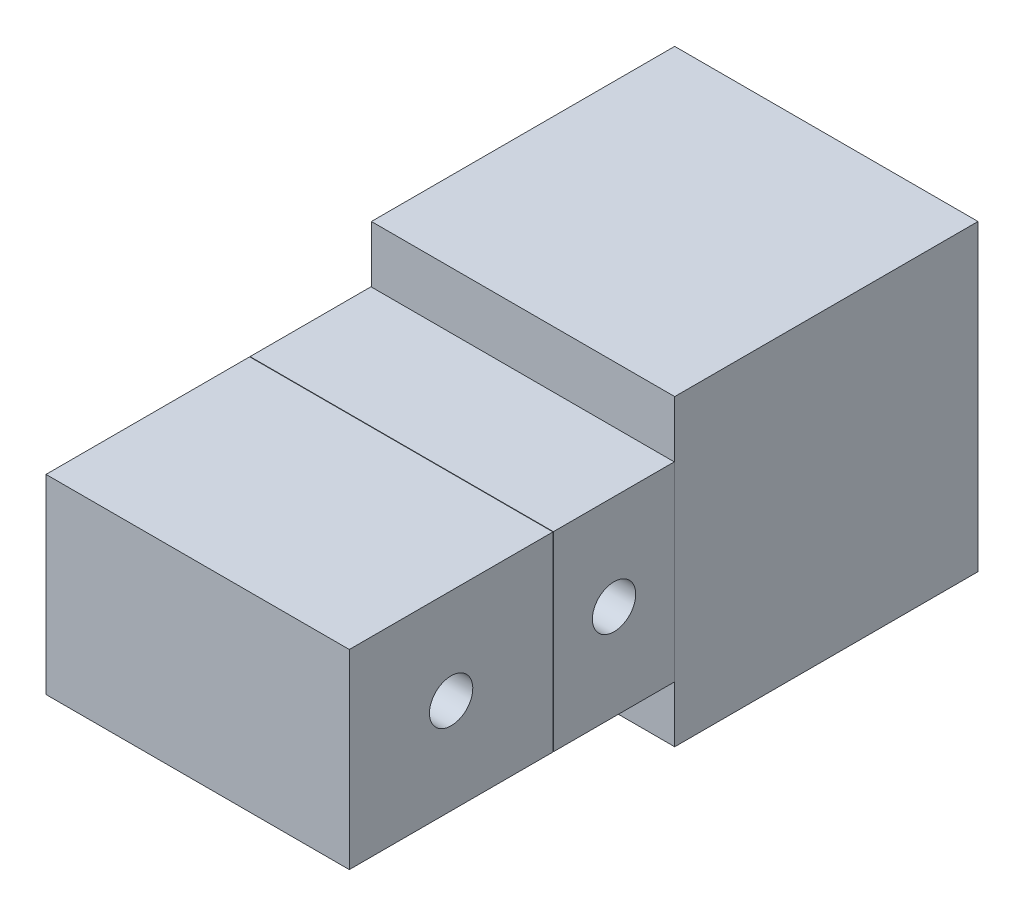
ISO-10303-21;
HEADER;
FILE_DESCRIPTION(('STEP AP214'),'2;1');
FILE_NAME('part.step','',(''),(''),'','','');
FILE_SCHEMA(('AUTOMOTIVE_DESIGN { 1 0 10303 214 1 1 1 1 }'));
ENDSEC;
DATA;
#1=APPLICATION_CONTEXT('core data for automotive mechanical design processes');
#2=APPLICATION_PROTOCOL_DEFINITION('international standard','automotive_design',2000,#1);
#3=PRODUCT_CONTEXT('',#1,'mechanical');
#4=PRODUCT('Part','Part','',(#3));
#5=PRODUCT_RELATED_PRODUCT_CATEGORY('part','',(#4));
#6=PRODUCT_DEFINITION_FORMATION('','',#4);
#7=PRODUCT_DEFINITION_CONTEXT('part definition',#1,'design');
#8=PRODUCT_DEFINITION('design','',#6,#7);
#9=PRODUCT_DEFINITION_SHAPE('','',#8);
#10=(LENGTH_UNIT() NAMED_UNIT(*) SI_UNIT(.MILLI.,.METRE.));
#11=(NAMED_UNIT(*) PLANE_ANGLE_UNIT() SI_UNIT($,.RADIAN.));
#12=(NAMED_UNIT(*) SI_UNIT($,.STERADIAN.) SOLID_ANGLE_UNIT());
#13=UNCERTAINTY_MEASURE_WITH_UNIT(LENGTH_MEASURE(1.E-05),#10,'distance_accuracy_value','');
#14=(GEOMETRIC_REPRESENTATION_CONTEXT(3) GLOBAL_UNCERTAINTY_ASSIGNED_CONTEXT((#13)) GLOBAL_UNIT_ASSIGNED_CONTEXT((#10,
#11,#12)) REPRESENTATION_CONTEXT('',''));
#15=CARTESIAN_POINT('',(0.,0.,0.));
#16=DIRECTION('',(0.,0.,1.));
#17=DIRECTION('',(1.,0.,0.));
#18=AXIS2_PLACEMENT_3D('',#15,#16,#17);
#19=CARTESIAN_POINT('',(-35.,-22.,145.1));
#20=DIRECTION('',(1.,0.,0.));
#21=DIRECTION('',(0.,1.,0.));
#22=AXIS2_PLACEMENT_3D('',#19,#20,#21);
#23=PLANE('',#22);
#24=CARTESIAN_POINT('',(-35.,0.,121.6));
#25=DIRECTION('',(-1.,0.,0.));
#26=DIRECTION('',(0.,-1.,0.));
#27=AXIS2_PLACEMENT_3D('',#24,#25,#26);
#28=CIRCLE('',#27,5.00000000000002);
#29=CARTESIAN_POINT('',(-35.,-5.00000000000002,121.6));
#30=VERTEX_POINT('',#29);
#31=EDGE_CURVE('E101',#30,#30,#28,.T.);
#32=ORIENTED_EDGE('',*,*,#31,.F.);
#33=EDGE_LOOP('',(#32));
#34=FACE_BOUND('',#33,.T.);
#35=DIRECTION('',(0.,-1.,0.));
#36=VECTOR('',#35,1.);
#37=CARTESIAN_POINT('',(-35.,-22.,98.1));
#38=LINE('',#37,#36);
#39=CARTESIAN_POINT('',(-35.,22.,98.1));
#40=VERTEX_POINT('',#39);
#41=CARTESIAN_POINT('',(-35.,-22.,98.1));
#42=VERTEX_POINT('',#41);
#43=EDGE_CURVE('E85',#40,#42,#38,.T.);
#44=ORIENTED_EDGE('',*,*,#43,.T.);
#45=DIRECTION('',(0.,0.,-1.));
#46=VECTOR('',#45,1.);
#47=CARTESIAN_POINT('',(-35.,-22.,145.1));
#48=LINE('',#47,#46);
#49=CARTESIAN_POINT('',(-35.,-22.,145.1));
#50=VERTEX_POINT('',#49);
#51=EDGE_CURVE('E12',#50,#42,#48,.T.);
#52=ORIENTED_EDGE('',*,*,#51,.F.);
#53=DIRECTION('',(0.,-1.,0.));
#54=VECTOR('',#53,1.);
#55=CARTESIAN_POINT('',(-35.,-22.,145.1));
#56=LINE('',#55,#54);
#57=CARTESIAN_POINT('',(-35.,22.,145.1));
#58=VERTEX_POINT('',#57);
#59=EDGE_CURVE('E108',#58,#50,#56,.T.);
#60=ORIENTED_EDGE('',*,*,#59,.F.);
#61=DIRECTION('',(0.,0.,-1.));
#62=VECTOR('',#61,1.);
#63=CARTESIAN_POINT('',(-35.,22.,145.1));
#64=LINE('',#63,#62);
#65=EDGE_CURVE('E97',#58,#40,#64,.T.);
#66=ORIENTED_EDGE('',*,*,#65,.T.);
#67=EDGE_LOOP('',(#44,#52,#60,#66));
#68=FACE_BOUND('',#67,.T.);
#69=ADVANCED_FACE('F41',(#34,#68),#23,.F.);
#70=CARTESIAN_POINT('',(35.,-22.,145.1));
#71=DIRECTION('',(0.,1.,0.));
#72=DIRECTION('',(0.,0.,1.));
#73=AXIS2_PLACEMENT_3D('',#70,#71,#72);
#74=PLANE('',#73);
#75=DIRECTION('',(1.,0.,0.));
#76=VECTOR('',#75,1.);
#77=CARTESIAN_POINT('',(35.,-22.,98.1));
#78=LINE('',#77,#76);
#79=CARTESIAN_POINT('',(35.,-22.,98.1));
#80=VERTEX_POINT('',#79);
#81=EDGE_CURVE('E81',#42,#80,#78,.T.);
#82=ORIENTED_EDGE('',*,*,#81,.T.);
#83=DIRECTION('',(0.,0.,-1.));
#84=VECTOR('',#83,1.);
#85=CARTESIAN_POINT('',(35.,-22.,145.1));
#86=LINE('',#85,#84);
#87=CARTESIAN_POINT('',(35.,-22.,145.1));
#88=VERTEX_POINT('',#87);
#89=EDGE_CURVE('E48',#88,#80,#86,.T.);
#90=ORIENTED_EDGE('',*,*,#89,.F.);
#91=DIRECTION('',(1.,0.,0.));
#92=VECTOR('',#91,1.);
#93=CARTESIAN_POINT('',(35.,-22.,145.1));
#94=LINE('',#93,#92);
#95=EDGE_CURVE('E93',#50,#88,#94,.T.);
#96=ORIENTED_EDGE('',*,*,#95,.F.);
#97=ORIENTED_EDGE('',*,*,#51,.T.);
#98=EDGE_LOOP('',(#82,#90,#96,#97));
#99=FACE_BOUND('',#98,.T.);
#100=ADVANCED_FACE('F92',(#99),#74,.F.);
#101=CARTESIAN_POINT('',(35.,22.,145.1));
#102=DIRECTION('',(-1.,0.,0.));
#103=DIRECTION('',(0.,-1.,0.));
#104=AXIS2_PLACEMENT_3D('',#101,#102,#103);
#105=PLANE('',#104);
#106=CARTESIAN_POINT('',(35.,0.,121.6));
#107=DIRECTION('',(-1.,0.,0.));
#108=DIRECTION('',(0.,-1.,0.));
#109=AXIS2_PLACEMENT_3D('',#106,#107,#108);
#110=CIRCLE('',#109,5.00000000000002);
#111=CARTESIAN_POINT('',(35.,-5.00000000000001,121.6));
#112=VERTEX_POINT('',#111);
#113=EDGE_CURVE('E98',#112,#112,#110,.T.);
#114=ORIENTED_EDGE('',*,*,#113,.T.);
#115=EDGE_LOOP('',(#114));
#116=FACE_BOUND('',#115,.T.);
#117=DIRECTION('',(0.,1.,0.));
#118=VECTOR('',#117,1.);
#119=CARTESIAN_POINT('',(35.,22.,98.1));
#120=LINE('',#119,#118);
#121=CARTESIAN_POINT('',(35.,22.,98.1));
#122=VERTEX_POINT('',#121);
#123=EDGE_CURVE('E86',#80,#122,#120,.T.);
#124=ORIENTED_EDGE('',*,*,#123,.T.);
#125=DIRECTION('',(0.,0.,-1.));
#126=VECTOR('',#125,1.);
#127=CARTESIAN_POINT('',(35.,22.,145.1));
#128=LINE('',#127,#126);
#129=CARTESIAN_POINT('',(35.,22.,145.1));
#130=VERTEX_POINT('',#129);
#131=EDGE_CURVE('E114',#130,#122,#128,.T.);
#132=ORIENTED_EDGE('',*,*,#131,.F.);
#133=DIRECTION('',(0.,1.,0.));
#134=VECTOR('',#133,1.);
#135=CARTESIAN_POINT('',(35.,22.,145.1));
#136=LINE('',#135,#134);
#137=EDGE_CURVE('E60',#88,#130,#136,.T.);
#138=ORIENTED_EDGE('',*,*,#137,.F.);
#139=ORIENTED_EDGE('',*,*,#89,.T.);
#140=EDGE_LOOP('',(#124,#132,#138,#139));
#141=FACE_BOUND('',#140,.T.);
#142=ADVANCED_FACE('F117',(#116,#141),#105,.F.);
#143=CARTESIAN_POINT('',(-35.,22.,145.1));
#144=DIRECTION('',(0.,-1.,0.));
#145=DIRECTION('',(0.,0.,-1.));
#146=AXIS2_PLACEMENT_3D('',#143,#144,#145);
#147=PLANE('',#146);
#148=DIRECTION('',(-1.,0.,0.));
#149=VECTOR('',#148,1.);
#150=CARTESIAN_POINT('',(-35.,22.,98.1));
#151=LINE('',#150,#149);
#152=EDGE_CURVE('E106',#122,#40,#151,.T.);
#153=ORIENTED_EDGE('',*,*,#152,.T.);
#154=ORIENTED_EDGE('',*,*,#65,.F.);
#155=DIRECTION('',(-1.,0.,0.));
#156=VECTOR('',#155,1.);
#157=CARTESIAN_POINT('',(-35.,22.,145.1));
#158=LINE('',#157,#156);
#159=EDGE_CURVE('E55',#130,#58,#158,.T.);
#160=ORIENTED_EDGE('',*,*,#159,.F.);
#161=ORIENTED_EDGE('',*,*,#131,.T.);
#162=EDGE_LOOP('',(#153,#154,#160,#161));
#163=FACE_BOUND('',#162,.T.);
#164=ADVANCED_FACE('F119',(#163),#147,.F.);
#165=CARTESIAN_POINT('',(-35.,22.,145.1));
#166=DIRECTION('',(0.,0.,-1.));
#167=DIRECTION('',(-1.,0.,0.));
#168=AXIS2_PLACEMENT_3D('',#165,#166,#167);
#169=PLANE('',#168);
#170=ORIENTED_EDGE('',*,*,#59,.T.);
#171=ORIENTED_EDGE('',*,*,#95,.T.);
#172=ORIENTED_EDGE('',*,*,#137,.T.);
#173=ORIENTED_EDGE('',*,*,#159,.T.);
#174=EDGE_LOOP('',(#170,#171,#172,#173));
#175=FACE_BOUND('',#174,.T.);
#176=ADVANCED_FACE('F120',(#175),#169,.F.);
#177=CARTESIAN_POINT('',(-35.,22.,98.1));
#178=DIRECTION('',(0.,0.,-1.));
#179=DIRECTION('',(-1.,0.,0.));
#180=AXIS2_PLACEMENT_3D('',#177,#178,#179);
#181=PLANE('',#180);
#182=ORIENTED_EDGE('',*,*,#43,.F.);
#183=ORIENTED_EDGE('',*,*,#152,.F.);
#184=ORIENTED_EDGE('',*,*,#123,.F.);
#185=ORIENTED_EDGE('',*,*,#81,.F.);
#186=EDGE_LOOP('',(#182,#183,#184,#185));
#187=FACE_BOUND('',#186,.T.);
#188=ADVANCED_FACE('F82',(#187),#181,.T.);
#189=CARTESIAN_POINT('',(35.,0.,121.6));
#190=DIRECTION('',(-1.,0.,0.));
#191=DIRECTION('',(0.,-1.,0.));
#192=AXIS2_PLACEMENT_3D('',#189,#190,#191);
#193=CYLINDRICAL_SURFACE('',#192,5.00000000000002);
#194=ORIENTED_EDGE('',*,*,#113,.F.);
#195=EDGE_LOOP('',(#194));
#196=FACE_BOUND('',#195,.T.);
#197=ORIENTED_EDGE('',*,*,#31,.T.);
#198=EDGE_LOOP('',(#197));
#199=FACE_BOUND('',#198,.T.);
#200=ADVANCED_FACE('F127',(#196,#199),#193,.F.);
#201=CLOSED_SHELL('',(#69,#100,#142,#164,#176,#188,#200));
#202=MANIFOLD_SOLID_BREP('B2',#201);
#203=CARTESIAN_POINT('',(35.,22.,98.));
#204=DIRECTION('',(0.,-1.,0.));
#205=DIRECTION('',(0.,0.,-1.));
#206=AXIS2_PLACEMENT_3D('',#203,#204,#205);
#207=PLANE('',#206);
#208=DIRECTION('',(-1.,0.,0.));
#209=VECTOR('',#208,1.);
#210=CARTESIAN_POINT('',(35.,22.,70.1));
#211=LINE('',#210,#209);
#212=CARTESIAN_POINT('',(35.,22.,70.1));
#213=VERTEX_POINT('',#212);
#214=CARTESIAN_POINT('',(-35.,22.,70.1));
#215=VERTEX_POINT('',#214);
#216=EDGE_CURVE('E238',#213,#215,#211,.T.);
#217=ORIENTED_EDGE('',*,*,#216,.T.);
#218=DIRECTION('',(0.,0.,-1.));
#219=VECTOR('',#218,1.);
#220=CARTESIAN_POINT('',(-35.,22.,98.));
#221=LINE('',#220,#219);
#222=CARTESIAN_POINT('',(-35.,22.,98.));
#223=VERTEX_POINT('',#222);
#224=EDGE_CURVE('E39',#223,#215,#221,.T.);
#225=ORIENTED_EDGE('',*,*,#224,.F.);
#226=DIRECTION('',(-1.,0.,0.));
#227=VECTOR('',#226,1.);
#228=CARTESIAN_POINT('',(35.,22.,98.));
#229=LINE('',#228,#227);
#230=CARTESIAN_POINT('',(35.,22.,98.));
#231=VERTEX_POINT('',#230);
#232=EDGE_CURVE('E261',#231,#223,#229,.T.);
#233=ORIENTED_EDGE('',*,*,#232,.F.);
#234=DIRECTION('',(0.,0.,-1.));
#235=VECTOR('',#234,1.);
#236=CARTESIAN_POINT('',(35.,22.,98.));
#237=LINE('',#236,#235);
#238=EDGE_CURVE('E250',#231,#213,#237,.T.);
#239=ORIENTED_EDGE('',*,*,#238,.T.);
#240=EDGE_LOOP('',(#217,#225,#233,#239));
#241=FACE_BOUND('',#240,.T.);
#242=ADVANCED_FACE('F194',(#241),#207,.F.);
#243=CARTESIAN_POINT('',(-35.,22.,98.));
#244=DIRECTION('',(1.,0.,0.));
#245=DIRECTION('',(0.,1.,0.));
#246=AXIS2_PLACEMENT_3D('',#243,#244,#245);
#247=PLANE('',#246);
#248=CARTESIAN_POINT('',(-35.,0.,84.));
#249=DIRECTION('',(-1.,0.,0.));
#250=DIRECTION('',(0.,-1.,0.));
#251=AXIS2_PLACEMENT_3D('',#248,#249,#250);
#252=CIRCLE('',#251,5.);
#253=CARTESIAN_POINT('',(-35.,-5.00000000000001,84.));
#254=VERTEX_POINT('',#253);
#255=EDGE_CURVE('E254',#254,#254,#252,.T.);
#256=ORIENTED_EDGE('',*,*,#255,.F.);
#257=EDGE_LOOP('',(#256));
#258=FACE_BOUND('',#257,.T.);
#259=DIRECTION('',(0.,-1.,0.));
#260=VECTOR('',#259,1.);
#261=CARTESIAN_POINT('',(-35.,22.,70.1));
#262=LINE('',#261,#260);
#263=CARTESIAN_POINT('',(-35.,-22.,70.1));
#264=VERTEX_POINT('',#263);
#265=EDGE_CURVE('E234',#215,#264,#262,.T.);
#266=ORIENTED_EDGE('',*,*,#265,.T.);
#267=DIRECTION('',(0.,0.,-1.));
#268=VECTOR('',#267,1.);
#269=CARTESIAN_POINT('',(-35.,-22.,98.));
#270=LINE('',#269,#268);
#271=CARTESIAN_POINT('',(-35.,-22.,98.));
#272=VERTEX_POINT('',#271);
#273=EDGE_CURVE('E201',#272,#264,#270,.T.);
#274=ORIENTED_EDGE('',*,*,#273,.F.);
#275=DIRECTION('',(0.,-1.,0.));
#276=VECTOR('',#275,1.);
#277=CARTESIAN_POINT('',(-35.,22.,98.));
#278=LINE('',#277,#276);
#279=EDGE_CURVE('E246',#223,#272,#278,.T.);
#280=ORIENTED_EDGE('',*,*,#279,.F.);
#281=ORIENTED_EDGE('',*,*,#224,.T.);
#282=EDGE_LOOP('',(#266,#274,#280,#281));
#283=FACE_BOUND('',#282,.T.);
#284=ADVANCED_FACE('F245',(#258,#283),#247,.F.);
#285=CARTESIAN_POINT('',(-35.,-22.,98.));
#286=DIRECTION('',(0.,1.,0.));
#287=DIRECTION('',(0.,0.,1.));
#288=AXIS2_PLACEMENT_3D('',#285,#286,#287);
#289=PLANE('',#288);
#290=DIRECTION('',(1.,0.,0.));
#291=VECTOR('',#290,1.);
#292=CARTESIAN_POINT('',(-35.,-22.,70.1));
#293=LINE('',#292,#291);
#294=CARTESIAN_POINT('',(35.,-22.,70.1));
#295=VERTEX_POINT('',#294);
#296=EDGE_CURVE('E239',#264,#295,#293,.T.);
#297=ORIENTED_EDGE('',*,*,#296,.T.);
#298=DIRECTION('',(0.,0.,-1.));
#299=VECTOR('',#298,1.);
#300=CARTESIAN_POINT('',(35.,-22.,98.));
#301=LINE('',#300,#299);
#302=CARTESIAN_POINT('',(35.,-22.,98.));
#303=VERTEX_POINT('',#302);
#304=EDGE_CURVE('E267',#303,#295,#301,.T.);
#305=ORIENTED_EDGE('',*,*,#304,.F.);
#306=DIRECTION('',(1.,0.,0.));
#307=VECTOR('',#306,1.);
#308=CARTESIAN_POINT('',(-35.,-22.,98.));
#309=LINE('',#308,#307);
#310=EDGE_CURVE('E213',#272,#303,#309,.T.);
#311=ORIENTED_EDGE('',*,*,#310,.F.);
#312=ORIENTED_EDGE('',*,*,#273,.T.);
#313=EDGE_LOOP('',(#297,#305,#311,#312));
#314=FACE_BOUND('',#313,.T.);
#315=ADVANCED_FACE('F270',(#314),#289,.F.);
#316=CARTESIAN_POINT('',(35.,-22.,98.));
#317=DIRECTION('',(-1.,0.,0.));
#318=DIRECTION('',(0.,-1.,0.));
#319=AXIS2_PLACEMENT_3D('',#316,#317,#318);
#320=PLANE('',#319);
#321=CARTESIAN_POINT('',(35.,0.,84.));
#322=DIRECTION('',(-1.,0.,0.));
#323=DIRECTION('',(0.,-1.,0.));
#324=AXIS2_PLACEMENT_3D('',#321,#322,#323);
#325=CIRCLE('',#324,5.);
#326=CARTESIAN_POINT('',(35.,-5.,84.));
#327=VERTEX_POINT('',#326);
#328=EDGE_CURVE('E251',#327,#327,#325,.T.);
#329=ORIENTED_EDGE('',*,*,#328,.T.);
#330=EDGE_LOOP('',(#329));
#331=FACE_BOUND('',#330,.T.);
#332=DIRECTION('',(0.,1.,0.));
#333=VECTOR('',#332,1.);
#334=CARTESIAN_POINT('',(35.,-22.,70.1));
#335=LINE('',#334,#333);
#336=EDGE_CURVE('E259',#295,#213,#335,.T.);
#337=ORIENTED_EDGE('',*,*,#336,.T.);
#338=ORIENTED_EDGE('',*,*,#238,.F.);
#339=DIRECTION('',(0.,1.,0.));
#340=VECTOR('',#339,1.);
#341=CARTESIAN_POINT('',(35.,-22.,98.));
#342=LINE('',#341,#340);
#343=EDGE_CURVE('E208',#303,#231,#342,.T.);
#344=ORIENTED_EDGE('',*,*,#343,.F.);
#345=ORIENTED_EDGE('',*,*,#304,.T.);
#346=EDGE_LOOP('',(#337,#338,#344,#345));
#347=FACE_BOUND('',#346,.T.);
#348=ADVANCED_FACE('F272',(#331,#347),#320,.F.);
#349=CARTESIAN_POINT('',(-35.,22.,98.));
#350=DIRECTION('',(0.,0.,1.));
#351=DIRECTION('',(1.,0.,0.));
#352=AXIS2_PLACEMENT_3D('',#349,#350,#351);
#353=PLANE('',#352);
#354=ORIENTED_EDGE('',*,*,#232,.T.);
#355=ORIENTED_EDGE('',*,*,#279,.T.);
#356=ORIENTED_EDGE('',*,*,#310,.T.);
#357=ORIENTED_EDGE('',*,*,#343,.T.);
#358=EDGE_LOOP('',(#354,#355,#356,#357));
#359=FACE_BOUND('',#358,.T.);
#360=ADVANCED_FACE('F273',(#359),#353,.T.);
#361=CARTESIAN_POINT('',(-35.,22.,70.1));
#362=DIRECTION('',(0.,0.,1.));
#363=DIRECTION('',(1.,0.,0.));
#364=AXIS2_PLACEMENT_3D('',#361,#362,#363);
#365=PLANE('',#364);
#366=ORIENTED_EDGE('',*,*,#216,.F.);
#367=ORIENTED_EDGE('',*,*,#336,.F.);
#368=ORIENTED_EDGE('',*,*,#296,.F.);
#369=ORIENTED_EDGE('',*,*,#265,.F.);
#370=EDGE_LOOP('',(#366,#367,#368,#369));
#371=FACE_BOUND('',#370,.T.);
#372=ADVANCED_FACE('F235',(#371),#365,.F.);
#373=CARTESIAN_POINT('',(35.,0.,84.));
#374=DIRECTION('',(-1.,0.,0.));
#375=DIRECTION('',(0.,-1.,0.));
#376=AXIS2_PLACEMENT_3D('',#373,#374,#375);
#377=CYLINDRICAL_SURFACE('',#376,5.);
#378=ORIENTED_EDGE('',*,*,#328,.F.);
#379=EDGE_LOOP('',(#378));
#380=FACE_BOUND('',#379,.T.);
#381=ORIENTED_EDGE('',*,*,#255,.T.);
#382=EDGE_LOOP('',(#381));
#383=FACE_BOUND('',#382,.T.);
#384=ADVANCED_FACE('F280',(#380,#383),#377,.F.);
#385=CLOSED_SHELL('',(#242,#284,#315,#348,#360,#372,#384));
#386=MANIFOLD_SOLID_BREP('B6',#385);
#387=CARTESIAN_POINT('',(-35.,35.,70.));
#388=DIRECTION('',(1.,0.,0.));
#389=DIRECTION('',(0.,1.,0.));
#390=AXIS2_PLACEMENT_3D('',#387,#388,#389);
#391=PLANE('',#390);
#392=CARTESIAN_POINT('',(-35.,0.,15.));
#393=DIRECTION('',(1.,0.,0.));
#394=DIRECTION('',(0.,1.,0.));
#395=AXIS2_PLACEMENT_3D('',#392,#393,#394);
#396=CIRCLE('',#395,5.);
#397=CARTESIAN_POINT('',(-35.,5.,15.));
#398=VERTEX_POINT('',#397);
#399=EDGE_CURVE('E450',#398,#398,#396,.T.);
#400=ORIENTED_EDGE('',*,*,#399,.T.);
#401=EDGE_LOOP('',(#400));
#402=FACE_BOUND('',#401,.T.);
#403=DIRECTION('',(0.,-1.,0.));
#404=VECTOR('',#403,1.);
#405=CARTESIAN_POINT('',(-35.,35.,0.));
#406=LINE('',#405,#404);
#407=CARTESIAN_POINT('',(-35.,35.,0.));
#408=VERTEX_POINT('',#407);
#409=CARTESIAN_POINT('',(-35.,-35.,0.));
#410=VERTEX_POINT('',#409);
#411=EDGE_CURVE('E492',#408,#410,#406,.T.);
#412=ORIENTED_EDGE('',*,*,#411,.T.);
#413=DIRECTION('',(0.,0.,-1.));
#414=VECTOR('',#413,1.);
#415=CARTESIAN_POINT('',(-35.,-35.,70.));
#416=LINE('',#415,#414);
#417=CARTESIAN_POINT('',(-35.,-35.,70.));
#418=VERTEX_POINT('',#417);
#419=EDGE_CURVE('E192',#418,#410,#416,.T.);
#420=ORIENTED_EDGE('',*,*,#419,.F.);
#421=DIRECTION('',(0.,-1.,0.));
#422=VECTOR('',#421,1.);
#423=CARTESIAN_POINT('',(-35.,35.,70.));
#424=LINE('',#423,#422);
#425=CARTESIAN_POINT('',(-35.,35.,70.));
#426=VERTEX_POINT('',#425);
#427=EDGE_CURVE('E501',#426,#418,#424,.T.);
#428=ORIENTED_EDGE('',*,*,#427,.F.);
#429=DIRECTION('',(0.,0.,-1.));
#430=VECTOR('',#429,1.);
#431=CARTESIAN_POINT('',(-35.,35.,70.));
#432=LINE('',#431,#430);
#433=EDGE_CURVE('E507',#426,#408,#432,.T.);
#434=ORIENTED_EDGE('',*,*,#433,.T.);
#435=EDGE_LOOP('',(#412,#420,#428,#434));
#436=FACE_BOUND('',#435,.T.);
#437=CARTESIAN_POINT('',(-35.,0.,55.));
#438=DIRECTION('',(1.,0.,0.));
#439=DIRECTION('',(0.,1.,0.));
#440=AXIS2_PLACEMENT_3D('',#437,#438,#439);
#441=CIRCLE('',#440,5.);
#442=CARTESIAN_POINT('',(-35.,4.99999999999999,55.));
#443=VERTEX_POINT('',#442);
#444=EDGE_CURVE('E444',#443,#443,#441,.T.);
#445=ORIENTED_EDGE('',*,*,#444,.T.);
#446=EDGE_LOOP('',(#445));
#447=FACE_BOUND('',#446,.T.);
#448=ADVANCED_FACE('F338',(#402,#436,#447),#391,.F.);
#449=CARTESIAN_POINT('',(-35.,-35.,70.));
#450=DIRECTION('',(0.,1.,0.));
#451=DIRECTION('',(0.,0.,1.));
#452=AXIS2_PLACEMENT_3D('',#449,#450,#451);
#453=PLANE('',#452);
#454=CARTESIAN_POINT('',(27.5,-35.,7.5));
#455=DIRECTION('',(0.,-1.,0.));
#456=DIRECTION('',(0.,0.,-1.));
#457=AXIS2_PLACEMENT_3D('',#454,#455,#456);
#458=CIRCLE('',#457,4.5);
#459=CARTESIAN_POINT('',(27.5,-35.,3.));
#460=VERTEX_POINT('',#459);
#461=EDGE_CURVE('E400',#460,#460,#458,.T.);
#462=ORIENTED_EDGE('',*,*,#461,.F.);
#463=EDGE_LOOP('',(#462));
#464=FACE_BOUND('',#463,.T.);
#465=CARTESIAN_POINT('',(-27.5,-35.,7.5));
#466=DIRECTION('',(0.,-1.,0.));
#467=DIRECTION('',(0.,0.,-1.));
#468=AXIS2_PLACEMENT_3D('',#465,#466,#467);
#469=CIRCLE('',#468,4.5);
#470=CARTESIAN_POINT('',(-27.5,-35.,3.));
#471=VERTEX_POINT('',#470);
#472=EDGE_CURVE('E411',#471,#471,#469,.T.);
#473=ORIENTED_EDGE('',*,*,#472,.F.);
#474=EDGE_LOOP('',(#473));
#475=FACE_BOUND('',#474,.T.);
#476=CARTESIAN_POINT('',(-27.5,-35.,62.5));
#477=DIRECTION('',(0.,-1.,0.));
#478=DIRECTION('',(0.,0.,-1.));
#479=AXIS2_PLACEMENT_3D('',#476,#477,#478);
#480=CIRCLE('',#479,4.5);
#481=CARTESIAN_POINT('',(-27.5,-35.,58.));
#482=VERTEX_POINT('',#481);
#483=EDGE_CURVE('E420',#482,#482,#480,.T.);
#484=ORIENTED_EDGE('',*,*,#483,.F.);
#485=EDGE_LOOP('',(#484));
#486=FACE_BOUND('',#485,.T.);
#487=CARTESIAN_POINT('',(27.5,-35.,62.5));
#488=DIRECTION('',(0.,-1.,0.));
#489=DIRECTION('',(0.,0.,-1.));
#490=AXIS2_PLACEMENT_3D('',#487,#488,#489);
#491=CIRCLE('',#490,4.5);
#492=CARTESIAN_POINT('',(27.5,-35.,58.));
#493=VERTEX_POINT('',#492);
#494=EDGE_CURVE('E429',#493,#493,#491,.T.);
#495=ORIENTED_EDGE('',*,*,#494,.F.);
#496=EDGE_LOOP('',(#495));
#497=FACE_BOUND('',#496,.T.);
#498=CARTESIAN_POINT('',(-20.,-35.,35.));
#499=DIRECTION('',(0.,1.,0.));
#500=DIRECTION('',(0.,0.,1.));
#501=AXIS2_PLACEMENT_3D('',#498,#499,#500);
#502=CIRCLE('',#501,5.);
#503=CARTESIAN_POINT('',(-20.,-35.,40.));
#504=VERTEX_POINT('',#503);
#505=EDGE_CURVE('E462',#504,#504,#502,.T.);
#506=ORIENTED_EDGE('',*,*,#505,.T.);
#507=EDGE_LOOP('',(#506));
#508=FACE_BOUND('',#507,.T.);
#509=DIRECTION('',(1.,0.,0.));
#510=VECTOR('',#509,1.);
#511=CARTESIAN_POINT('',(-35.,-35.,0.));
#512=LINE('',#511,#510);
#513=CARTESIAN_POINT('',(35.,-35.,0.));
#514=VERTEX_POINT('',#513);
#515=EDGE_CURVE('E495',#410,#514,#512,.T.);
#516=ORIENTED_EDGE('',*,*,#515,.T.);
#517=DIRECTION('',(0.,0.,-1.));
#518=VECTOR('',#517,1.);
#519=CARTESIAN_POINT('',(35.,-35.,70.));
#520=LINE('',#519,#518);
#521=CARTESIAN_POINT('',(35.,-35.,70.));
#522=VERTEX_POINT('',#521);
#523=EDGE_CURVE('E345',#522,#514,#520,.T.);
#524=ORIENTED_EDGE('',*,*,#523,.F.);
#525=DIRECTION('',(1.,0.,0.));
#526=VECTOR('',#525,1.);
#527=CARTESIAN_POINT('',(-35.,-35.,70.));
#528=LINE('',#527,#526);
#529=EDGE_CURVE('E503',#418,#522,#528,.T.);
#530=ORIENTED_EDGE('',*,*,#529,.F.);
#531=ORIENTED_EDGE('',*,*,#419,.T.);
#532=EDGE_LOOP('',(#516,#524,#530,#531));
#533=FACE_BOUND('',#532,.T.);
#534=CARTESIAN_POINT('',(20.,-35.,35.));
#535=DIRECTION('',(0.,1.,0.));
#536=DIRECTION('',(0.,0.,1.));
#537=AXIS2_PLACEMENT_3D('',#534,#535,#536);
#538=CIRCLE('',#537,5.);
#539=CARTESIAN_POINT('',(20.,-35.,40.));
#540=VERTEX_POINT('',#539);
#541=EDGE_CURVE('E456',#540,#540,#538,.T.);
#542=ORIENTED_EDGE('',*,*,#541,.T.);
#543=EDGE_LOOP('',(#542));
#544=FACE_BOUND('',#543,.T.);
#545=ADVANCED_FACE('F529',(#464,#475,#486,#497,#508,#533,#544),#453,.F.);
#546=CARTESIAN_POINT('',(35.,35.,70.));
#547=DIRECTION('',(-1.,0.,0.));
#548=DIRECTION('',(0.,-1.,0.));
#549=AXIS2_PLACEMENT_3D('',#546,#547,#548);
#550=PLANE('',#549);
#551=DIRECTION('',(0.,1.,0.));
#552=VECTOR('',#551,1.);
#553=CARTESIAN_POINT('',(35.,35.,0.));
#554=LINE('',#553,#552);
#555=CARTESIAN_POINT('',(35.,35.,0.));
#556=VERTEX_POINT('',#555);
#557=EDGE_CURVE('E497',#514,#556,#554,.T.);
#558=ORIENTED_EDGE('',*,*,#557,.T.);
#559=DIRECTION('',(0.,0.,-1.));
#560=VECTOR('',#559,1.);
#561=CARTESIAN_POINT('',(35.,35.,70.));
#562=LINE('',#561,#560);
#563=CARTESIAN_POINT('',(35.,35.,70.));
#564=VERTEX_POINT('',#563);
#565=EDGE_CURVE('E510',#564,#556,#562,.T.);
#566=ORIENTED_EDGE('',*,*,#565,.F.);
#567=DIRECTION('',(0.,1.,0.));
#568=VECTOR('',#567,1.);
#569=CARTESIAN_POINT('',(35.,35.,70.));
#570=LINE('',#569,#568);
#571=EDGE_CURVE('E357',#522,#564,#570,.T.);
#572=ORIENTED_EDGE('',*,*,#571,.F.);
#573=ORIENTED_EDGE('',*,*,#523,.T.);
#574=EDGE_LOOP('',(#558,#566,#572,#573));
#575=FACE_BOUND('',#574,.T.);
#576=ADVANCED_FACE('F516',(#575),#550,.F.);
#577=CARTESIAN_POINT('',(-35.,35.,70.));
#578=DIRECTION('',(0.,-1.,0.));
#579=DIRECTION('',(0.,0.,-1.));
#580=AXIS2_PLACEMENT_3D('',#577,#578,#579);
#581=PLANE('',#580);
#582=DIRECTION('',(-1.,0.,0.));
#583=VECTOR('',#582,1.);
#584=CARTESIAN_POINT('',(-35.,35.,0.));
#585=LINE('',#584,#583);
#586=EDGE_CURVE('E499',#556,#408,#585,.T.);
#587=ORIENTED_EDGE('',*,*,#586,.T.);
#588=ORIENTED_EDGE('',*,*,#433,.F.);
#589=DIRECTION('',(-1.,0.,0.));
#590=VECTOR('',#589,1.);
#591=CARTESIAN_POINT('',(-35.,35.,70.));
#592=LINE('',#591,#590);
#593=EDGE_CURVE('E352',#564,#426,#592,.T.);
#594=ORIENTED_EDGE('',*,*,#593,.F.);
#595=ORIENTED_EDGE('',*,*,#565,.T.);
#596=EDGE_LOOP('',(#587,#588,#594,#595));
#597=FACE_BOUND('',#596,.T.);
#598=ADVANCED_FACE('F523',(#597),#581,.F.);
#599=CARTESIAN_POINT('',(-35.,-35.,70.));
#600=DIRECTION('',(0.,0.,1.));
#601=DIRECTION('',(1.,0.,0.));
#602=AXIS2_PLACEMENT_3D('',#599,#600,#601);
#603=PLANE('',#602);
#604=ORIENTED_EDGE('',*,*,#427,.T.);
#605=ORIENTED_EDGE('',*,*,#529,.T.);
#606=ORIENTED_EDGE('',*,*,#571,.T.);
#607=ORIENTED_EDGE('',*,*,#593,.T.);
#608=EDGE_LOOP('',(#604,#605,#606,#607));
#609=FACE_BOUND('',#608,.T.);
#610=ADVANCED_FACE('F528',(#609),#603,.T.);
#611=CARTESIAN_POINT('',(-35.,-35.,0.));
#612=DIRECTION('',(0.,0.,1.));
#613=DIRECTION('',(1.,0.,0.));
#614=AXIS2_PLACEMENT_3D('',#611,#612,#613);
#615=PLANE('',#614);
#616=CARTESIAN_POINT('',(0.,-29.,0.));
#617=DIRECTION('',(0.,0.,-1.));
#618=DIRECTION('',(-1.,0.,0.));
#619=AXIS2_PLACEMENT_3D('',#616,#617,#618);
#620=CIRCLE('',#619,2.5);
#621=CARTESIAN_POINT('',(-2.5,-29.,0.));
#622=VERTEX_POINT('',#621);
#623=EDGE_CURVE('E432',#622,#622,#620,.T.);
#624=ORIENTED_EDGE('',*,*,#623,.F.);
#625=EDGE_LOOP('',(#624));
#626=FACE_BOUND('',#625,.T.);
#627=CARTESIAN_POINT('',(0.,29.,0.));
#628=DIRECTION('',(0.,0.,-1.));
#629=DIRECTION('',(-1.,0.,0.));
#630=AXIS2_PLACEMENT_3D('',#627,#628,#629);
#631=CIRCLE('',#630,2.5);
#632=CARTESIAN_POINT('',(-2.5,29.,0.));
#633=VERTEX_POINT('',#632);
#634=EDGE_CURVE('E438',#633,#633,#631,.T.);
#635=ORIENTED_EDGE('',*,*,#634,.F.);
#636=EDGE_LOOP('',(#635));
#637=FACE_BOUND('',#636,.T.);
#638=CARTESIAN_POINT('',(19.,-17.,0.));
#639=DIRECTION('',(0.,0.,-1.));
#640=DIRECTION('',(-1.,0.,0.));
#641=AXIS2_PLACEMENT_3D('',#638,#639,#640);
#642=CIRCLE('',#641,4.);
#643=CARTESIAN_POINT('',(15.,-17.,0.));
#644=VERTEX_POINT('',#643);
#645=EDGE_CURVE('E468',#644,#644,#642,.T.);
#646=ORIENTED_EDGE('',*,*,#645,.F.);
#647=EDGE_LOOP('',(#646));
#648=FACE_BOUND('',#647,.T.);
#649=CARTESIAN_POINT('',(-19.,-17.,0.));
#650=DIRECTION('',(0.,0.,-1.));
#651=DIRECTION('',(-1.,0.,0.));
#652=AXIS2_PLACEMENT_3D('',#649,#650,#651);
#653=CIRCLE('',#652,4.);
#654=CARTESIAN_POINT('',(-23.,-17.,0.));
#655=VERTEX_POINT('',#654);
#656=EDGE_CURVE('E474',#655,#655,#653,.T.);
#657=ORIENTED_EDGE('',*,*,#656,.F.);
#658=EDGE_LOOP('',(#657));
#659=FACE_BOUND('',#658,.T.);
#660=CARTESIAN_POINT('',(-19.,17.,0.));
#661=DIRECTION('',(0.,0.,-1.));
#662=DIRECTION('',(-1.,0.,0.));
#663=AXIS2_PLACEMENT_3D('',#660,#661,#662);
#664=CIRCLE('',#663,4.);
#665=CARTESIAN_POINT('',(-23.,17.,0.));
#666=VERTEX_POINT('',#665);
#667=EDGE_CURVE('E480',#666,#666,#664,.T.);
#668=ORIENTED_EDGE('',*,*,#667,.F.);
#669=EDGE_LOOP('',(#668));
#670=FACE_BOUND('',#669,.T.);
#671=CARTESIAN_POINT('',(19.,17.,0.));
#672=DIRECTION('',(0.,0.,-1.));
#673=DIRECTION('',(-1.,0.,0.));
#674=AXIS2_PLACEMENT_3D('',#671,#672,#673);
#675=CIRCLE('',#674,4.);
#676=CARTESIAN_POINT('',(15.,17.,0.));
#677=VERTEX_POINT('',#676);
#678=EDGE_CURVE('E486',#677,#677,#675,.T.);
#679=ORIENTED_EDGE('',*,*,#678,.F.);
#680=EDGE_LOOP('',(#679));
#681=FACE_BOUND('',#680,.T.);
#682=ORIENTED_EDGE('',*,*,#411,.F.);
#683=ORIENTED_EDGE('',*,*,#586,.F.);
#684=ORIENTED_EDGE('',*,*,#557,.F.);
#685=ORIENTED_EDGE('',*,*,#515,.F.);
#686=EDGE_LOOP('',(#682,#683,#684,#685));
#687=FACE_BOUND('',#686,.T.);
#688=ADVANCED_FACE('F521',(#626,#637,#648,#659,#670,#681,#687),#615,.F.);
#689=CARTESIAN_POINT('',(19.,17.,30.));
#690=DIRECTION('',(0.,0.,-1.));
#691=DIRECTION('',(-1.,0.,0.));
#692=AXIS2_PLACEMENT_3D('',#689,#690,#691);
#693=CYLINDRICAL_SURFACE('',#692,4.);
#694=CARTESIAN_POINT('',(19.,17.,30.));
#695=DIRECTION('',(0.,0.,-1.));
#696=DIRECTION('',(-1.,0.,0.));
#697=AXIS2_PLACEMENT_3D('',#694,#695,#696);
#698=CIRCLE('',#697,4.);
#699=CARTESIAN_POINT('',(15.,17.,30.));
#700=VERTEX_POINT('',#699);
#701=EDGE_CURVE('E489',#700,#700,#698,.T.);
#702=ORIENTED_EDGE('',*,*,#701,.F.);
#703=EDGE_LOOP('',(#702));
#704=FACE_BOUND('',#703,.T.);
#705=ORIENTED_EDGE('',*,*,#678,.T.);
#706=EDGE_LOOP('',(#705));
#707=FACE_BOUND('',#706,.T.);
#708=ADVANCED_FACE('F680',(#704,#707),#693,.F.);
#709=CARTESIAN_POINT('',(19.,17.,30.));
#710=DIRECTION('',(0.,0.,-1.));
#711=DIRECTION('',(-1.,0.,0.));
#712=AXIS2_PLACEMENT_3D('',#709,#710,#711);
#713=PLANE('',#712);
#714=ORIENTED_EDGE('',*,*,#701,.T.);
#715=EDGE_LOOP('',(#714));
#716=FACE_BOUND('',#715,.T.);
#717=ADVANCED_FACE('F676',(#716),#713,.T.);
#718=CARTESIAN_POINT('',(-19.,17.,30.));
#719=DIRECTION('',(0.,0.,-1.));
#720=DIRECTION('',(-1.,0.,0.));
#721=AXIS2_PLACEMENT_3D('',#718,#719,#720);
#722=CYLINDRICAL_SURFACE('',#721,4.);
#723=CARTESIAN_POINT('',(-19.,17.,30.));
#724=DIRECTION('',(0.,0.,-1.));
#725=DIRECTION('',(-1.,0.,0.));
#726=AXIS2_PLACEMENT_3D('',#723,#724,#725);
#727=CIRCLE('',#726,4.);
#728=CARTESIAN_POINT('',(-23.,17.,30.));
#729=VERTEX_POINT('',#728);
#730=EDGE_CURVE('E483',#729,#729,#727,.T.);
#731=ORIENTED_EDGE('',*,*,#730,.F.);
#732=EDGE_LOOP('',(#731));
#733=FACE_BOUND('',#732,.T.);
#734=ORIENTED_EDGE('',*,*,#667,.T.);
#735=EDGE_LOOP('',(#734));
#736=FACE_BOUND('',#735,.T.);
#737=ADVANCED_FACE('F672',(#733,#736),#722,.F.);
#738=CARTESIAN_POINT('',(-19.,17.,30.));
#739=DIRECTION('',(0.,0.,-1.));
#740=DIRECTION('',(-1.,0.,0.));
#741=AXIS2_PLACEMENT_3D('',#738,#739,#740);
#742=PLANE('',#741);
#743=ORIENTED_EDGE('',*,*,#730,.T.);
#744=EDGE_LOOP('',(#743));
#745=FACE_BOUND('',#744,.T.);
#746=ADVANCED_FACE('F668',(#745),#742,.T.);
#747=CARTESIAN_POINT('',(-19.,-17.,30.));
#748=DIRECTION('',(0.,0.,-1.));
#749=DIRECTION('',(-1.,0.,0.));
#750=AXIS2_PLACEMENT_3D('',#747,#748,#749);
#751=CYLINDRICAL_SURFACE('',#750,4.);
#752=CARTESIAN_POINT('',(-19.,-17.,30.));
#753=DIRECTION('',(0.,0.,-1.));
#754=DIRECTION('',(-1.,0.,0.));
#755=AXIS2_PLACEMENT_3D('',#752,#753,#754);
#756=CIRCLE('',#755,4.);
#757=CARTESIAN_POINT('',(-23.,-17.,30.));
#758=VERTEX_POINT('',#757);
#759=EDGE_CURVE('E477',#758,#758,#756,.T.);
#760=ORIENTED_EDGE('',*,*,#759,.F.);
#761=EDGE_LOOP('',(#760));
#762=FACE_BOUND('',#761,.T.);
#763=ORIENTED_EDGE('',*,*,#656,.T.);
#764=EDGE_LOOP('',(#763));
#765=FACE_BOUND('',#764,.T.);
#766=ADVANCED_FACE('F664',(#762,#765),#751,.F.);
#767=CARTESIAN_POINT('',(-19.,-17.,30.));
#768=DIRECTION('',(0.,0.,-1.));
#769=DIRECTION('',(-1.,0.,0.));
#770=AXIS2_PLACEMENT_3D('',#767,#768,#769);
#771=PLANE('',#770);
#772=ORIENTED_EDGE('',*,*,#759,.T.);
#773=EDGE_LOOP('',(#772));
#774=FACE_BOUND('',#773,.T.);
#775=ADVANCED_FACE('F660',(#774),#771,.T.);
#776=CARTESIAN_POINT('',(19.,-17.,30.));
#777=DIRECTION('',(0.,0.,-1.));
#778=DIRECTION('',(-1.,0.,0.));
#779=AXIS2_PLACEMENT_3D('',#776,#777,#778);
#780=CYLINDRICAL_SURFACE('',#779,4.);
#781=CARTESIAN_POINT('',(19.,-17.,30.));
#782=DIRECTION('',(0.,0.,-1.));
#783=DIRECTION('',(-1.,0.,0.));
#784=AXIS2_PLACEMENT_3D('',#781,#782,#783);
#785=CIRCLE('',#784,4.);
#786=CARTESIAN_POINT('',(15.,-17.,30.));
#787=VERTEX_POINT('',#786);
#788=EDGE_CURVE('E471',#787,#787,#785,.T.);
#789=ORIENTED_EDGE('',*,*,#788,.F.);
#790=EDGE_LOOP('',(#789));
#791=FACE_BOUND('',#790,.T.);
#792=ORIENTED_EDGE('',*,*,#645,.T.);
#793=EDGE_LOOP('',(#792));
#794=FACE_BOUND('',#793,.T.);
#795=ADVANCED_FACE('F654',(#791,#794),#780,.F.);
#796=CARTESIAN_POINT('',(19.,-17.,30.));
#797=DIRECTION('',(0.,0.,-1.));
#798=DIRECTION('',(-1.,0.,0.));
#799=AXIS2_PLACEMENT_3D('',#796,#797,#798);
#800=PLANE('',#799);
#801=ORIENTED_EDGE('',*,*,#788,.T.);
#802=EDGE_LOOP('',(#801));
#803=FACE_BOUND('',#802,.T.);
#804=ADVANCED_FACE('F648',(#803),#800,.T.);
#805=CARTESIAN_POINT('',(-20.,-25.,35.));
#806=DIRECTION('',(0.,-1.,0.));
#807=DIRECTION('',(0.,0.,-1.));
#808=AXIS2_PLACEMENT_3D('',#805,#806,#807);
#809=CYLINDRICAL_SURFACE('',#808,5.);
#810=CARTESIAN_POINT('',(-20.,-25.,35.));
#811=DIRECTION('',(0.,1.,0.));
#812=DIRECTION('',(0.,0.,1.));
#813=AXIS2_PLACEMENT_3D('',#810,#811,#812);
#814=CIRCLE('',#813,5.);
#815=CARTESIAN_POINT('',(-20.,-25.,40.));
#816=VERTEX_POINT('',#815);
#817=EDGE_CURVE('E465',#816,#816,#814,.T.);
#818=ORIENTED_EDGE('',*,*,#817,.T.);
#819=EDGE_LOOP('',(#818));
#820=FACE_BOUND('',#819,.T.);
#821=ORIENTED_EDGE('',*,*,#505,.F.);
#822=EDGE_LOOP('',(#821));
#823=FACE_BOUND('',#822,.T.);
#824=ADVANCED_FACE('F548',(#820,#823),#809,.F.);
#825=CARTESIAN_POINT('',(-20.,-25.,35.));
#826=DIRECTION('',(0.,1.,0.));
#827=DIRECTION('',(0.,0.,1.));
#828=AXIS2_PLACEMENT_3D('',#825,#826,#827);
#829=PLANE('',#828);
#830=ORIENTED_EDGE('',*,*,#817,.F.);
#831=EDGE_LOOP('',(#830));
#832=FACE_BOUND('',#831,.T.);
#833=ADVANCED_FACE('F538',(#832),#829,.F.);
#834=CARTESIAN_POINT('',(20.,-25.,35.));
#835=DIRECTION('',(0.,-1.,0.));
#836=DIRECTION('',(0.,0.,-1.));
#837=AXIS2_PLACEMENT_3D('',#834,#835,#836);
#838=CYLINDRICAL_SURFACE('',#837,5.);
#839=CARTESIAN_POINT('',(20.,-25.,35.));
#840=DIRECTION('',(0.,1.,0.));
#841=DIRECTION('',(0.,0.,1.));
#842=AXIS2_PLACEMENT_3D('',#839,#840,#841);
#843=CIRCLE('',#842,5.);
#844=CARTESIAN_POINT('',(20.,-25.,40.));
#845=VERTEX_POINT('',#844);
#846=EDGE_CURVE('E459',#845,#845,#843,.T.);
#847=ORIENTED_EDGE('',*,*,#846,.T.);
#848=EDGE_LOOP('',(#847));
#849=FACE_BOUND('',#848,.T.);
#850=ORIENTED_EDGE('',*,*,#541,.F.);
#851=EDGE_LOOP('',(#850));
#852=FACE_BOUND('',#851,.T.);
#853=ADVANCED_FACE('F535',(#849,#852),#838,.F.);
#854=CARTESIAN_POINT('',(20.,-25.,35.));
#855=DIRECTION('',(0.,1.,0.));
#856=DIRECTION('',(0.,0.,1.));
#857=AXIS2_PLACEMENT_3D('',#854,#855,#856);
#858=PLANE('',#857);
#859=ORIENTED_EDGE('',*,*,#846,.F.);
#860=EDGE_LOOP('',(#859));
#861=FACE_BOUND('',#860,.T.);
#862=ADVANCED_FACE('F537',(#861),#858,.F.);
#863=CARTESIAN_POINT('',(-25.,0.,15.));
#864=DIRECTION('',(-1.,0.,0.));
#865=DIRECTION('',(0.,-1.,0.));
#866=AXIS2_PLACEMENT_3D('',#863,#864,#865);
#867=CYLINDRICAL_SURFACE('',#866,5.);
#868=CARTESIAN_POINT('',(-25.,0.,15.));
#869=DIRECTION('',(1.,0.,0.));
#870=DIRECTION('',(0.,1.,0.));
#871=AXIS2_PLACEMENT_3D('',#868,#869,#870);
#872=CIRCLE('',#871,5.);
#873=CARTESIAN_POINT('',(-25.,5.,15.));
#874=VERTEX_POINT('',#873);
#875=EDGE_CURVE('E453',#874,#874,#872,.T.);
#876=ORIENTED_EDGE('',*,*,#875,.T.);
#877=EDGE_LOOP('',(#876));
#878=FACE_BOUND('',#877,.T.);
#879=ORIENTED_EDGE('',*,*,#399,.F.);
#880=EDGE_LOOP('',(#879));
#881=FACE_BOUND('',#880,.T.);
#882=ADVANCED_FACE('F545',(#878,#881),#867,.F.);
#883=CARTESIAN_POINT('',(-25.,0.,15.));
#884=DIRECTION('',(1.,0.,0.));
#885=DIRECTION('',(0.,1.,0.));
#886=AXIS2_PLACEMENT_3D('',#883,#884,#885);
#887=PLANE('',#886);
#888=ORIENTED_EDGE('',*,*,#875,.F.);
#889=EDGE_LOOP('',(#888));
#890=FACE_BOUND('',#889,.T.);
#891=ADVANCED_FACE('F558',(#890),#887,.F.);
#892=CARTESIAN_POINT('',(-25.,0.,55.));
#893=DIRECTION('',(-1.,0.,0.));
#894=DIRECTION('',(0.,-1.,0.));
#895=AXIS2_PLACEMENT_3D('',#892,#893,#894);
#896=CYLINDRICAL_SURFACE('',#895,5.);
#897=CARTESIAN_POINT('',(-25.,0.,55.));
#898=DIRECTION('',(1.,0.,0.));
#899=DIRECTION('',(0.,1.,0.));
#900=AXIS2_PLACEMENT_3D('',#897,#898,#899);
#901=CIRCLE('',#900,5.);
#902=CARTESIAN_POINT('',(-25.,4.99999999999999,55.));
#903=VERTEX_POINT('',#902);
#904=EDGE_CURVE('E447',#903,#903,#901,.T.);
#905=ORIENTED_EDGE('',*,*,#904,.T.);
#906=EDGE_LOOP('',(#905));
#907=FACE_BOUND('',#906,.T.);
#908=ORIENTED_EDGE('',*,*,#444,.F.);
#909=EDGE_LOOP('',(#908));
#910=FACE_BOUND('',#909,.T.);
#911=ADVANCED_FACE('F564',(#907,#910),#896,.F.);
#912=CARTESIAN_POINT('',(-25.,0.,55.));
#913=DIRECTION('',(1.,0.,0.));
#914=DIRECTION('',(0.,1.,0.));
#915=AXIS2_PLACEMENT_3D('',#912,#913,#914);
#916=PLANE('',#915);
#917=ORIENTED_EDGE('',*,*,#904,.F.);
#918=EDGE_LOOP('',(#917));
#919=FACE_BOUND('',#918,.T.);
#920=ADVANCED_FACE('F570',(#919),#916,.F.);
#921=CARTESIAN_POINT('',(0.,29.,10.));
#922=DIRECTION('',(0.,0.,-1.));
#923=DIRECTION('',(-1.,0.,0.));
#924=AXIS2_PLACEMENT_3D('',#921,#922,#923);
#925=CYLINDRICAL_SURFACE('',#924,2.5);
#926=CARTESIAN_POINT('',(0.,29.,10.));
#927=DIRECTION('',(0.,0.,-1.));
#928=DIRECTION('',(-1.,0.,0.));
#929=AXIS2_PLACEMENT_3D('',#926,#927,#928);
#930=CIRCLE('',#929,2.5);
#931=CARTESIAN_POINT('',(-2.5,29.,10.));
#932=VERTEX_POINT('',#931);
#933=EDGE_CURVE('E441',#932,#932,#930,.T.);
#934=ORIENTED_EDGE('',*,*,#933,.F.);
#935=EDGE_LOOP('',(#934));
#936=FACE_BOUND('',#935,.T.);
#937=ORIENTED_EDGE('',*,*,#634,.T.);
#938=EDGE_LOOP('',(#937));
#939=FACE_BOUND('',#938,.T.);
#940=ADVANCED_FACE('F574',(#936,#939),#925,.F.);
#941=CARTESIAN_POINT('',(0.,29.,10.));
#942=DIRECTION('',(0.,0.,-1.));
#943=DIRECTION('',(-1.,0.,0.));
#944=AXIS2_PLACEMENT_3D('',#941,#942,#943);
#945=PLANE('',#944);
#946=ORIENTED_EDGE('',*,*,#933,.T.);
#947=EDGE_LOOP('',(#946));
#948=FACE_BOUND('',#947,.T.);
#949=ADVANCED_FACE('F578',(#948),#945,.T.);
#950=CARTESIAN_POINT('',(0.,-29.,10.));
#951=DIRECTION('',(0.,0.,-1.));
#952=DIRECTION('',(-1.,0.,0.));
#953=AXIS2_PLACEMENT_3D('',#950,#951,#952);
#954=CYLINDRICAL_SURFACE('',#953,2.5);
#955=CARTESIAN_POINT('',(0.,-29.,10.));
#956=DIRECTION('',(0.,0.,-1.));
#957=DIRECTION('',(-1.,0.,0.));
#958=AXIS2_PLACEMENT_3D('',#955,#956,#957);
#959=CIRCLE('',#958,2.5);
#960=CARTESIAN_POINT('',(-2.5,-29.,10.));
#961=VERTEX_POINT('',#960);
#962=EDGE_CURVE('E435',#961,#961,#959,.T.);
#963=ORIENTED_EDGE('',*,*,#962,.F.);
#964=EDGE_LOOP('',(#963));
#965=FACE_BOUND('',#964,.T.);
#966=ORIENTED_EDGE('',*,*,#623,.T.);
#967=EDGE_LOOP('',(#966));
#968=FACE_BOUND('',#967,.T.);
#969=ADVANCED_FACE('F582',(#965,#968),#954,.F.);
#970=CARTESIAN_POINT('',(0.,-29.,10.));
#971=DIRECTION('',(0.,0.,-1.));
#972=DIRECTION('',(-1.,0.,0.));
#973=AXIS2_PLACEMENT_3D('',#970,#971,#972);
#974=PLANE('',#973);
#975=ORIENTED_EDGE('',*,*,#962,.T.);
#976=EDGE_LOOP('',(#975));
#977=FACE_BOUND('',#976,.T.);
#978=ADVANCED_FACE('F586',(#977),#974,.T.);
#979=CARTESIAN_POINT('',(27.5,-35.,62.5));
#980=DIRECTION('',(0.,-1.,0.));
#981=DIRECTION('',(0.,0.,-1.));
#982=AXIS2_PLACEMENT_3D('',#979,#980,#981);
#983=CONICAL_SURFACE('',#982,4.5,0.78539816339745);
#984=CARTESIAN_POINT('',(27.5,-33.9,62.5));
#985=DIRECTION('',(0.,-1.,0.));
#986=DIRECTION('',(0.,0.,-1.));
#987=AXIS2_PLACEMENT_3D('',#984,#985,#986);
#988=CIRCLE('',#987,3.4);
#989=CARTESIAN_POINT('',(27.5,-33.9,59.1));
#990=VERTEX_POINT('',#989);
#991=EDGE_CURVE('E426',#990,#990,#988,.T.);
#992=ORIENTED_EDGE('',*,*,#991,.F.);
#993=EDGE_LOOP('',(#992));
#994=FACE_BOUND('',#993,.T.);
#995=ORIENTED_EDGE('',*,*,#494,.T.);
#996=EDGE_LOOP('',(#995));
#997=FACE_BOUND('',#996,.T.);
#998=ADVANCED_FACE('F590',(#994,#997),#983,.F.);
#999=CARTESIAN_POINT('',(27.5,-35.,62.5));
#1000=DIRECTION('',(0.,-1.,0.));
#1001=DIRECTION('',(0.,0.,-1.));
#1002=AXIS2_PLACEMENT_3D('',#999,#1000,#1001);
#1003=CYLINDRICAL_SURFACE('',#1002,3.4);
#1004=CARTESIAN_POINT('',(27.5,-12.75,62.5));
#1005=DIRECTION('',(0.,-1.,0.));
#1006=DIRECTION('',(0.,0.,-1.));
#1007=AXIS2_PLACEMENT_3D('',#1004,#1005,#1006);
#1008=CIRCLE('',#1007,3.39999999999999);
#1009=CARTESIAN_POINT('',(27.5,-12.75,59.1));
#1010=VERTEX_POINT('',#1009);
#1011=EDGE_CURVE('E423',#1010,#1010,#1008,.T.);
#1012=ORIENTED_EDGE('',*,*,#1011,.F.);
#1013=EDGE_LOOP('',(#1012));
#1014=FACE_BOUND('',#1013,.T.);
#1015=ORIENTED_EDGE('',*,*,#991,.T.);
#1016=EDGE_LOOP('',(#1015));
#1017=FACE_BOUND('',#1016,.T.);
#1018=ADVANCED_FACE('F594',(#1014,#1017),#1003,.F.);
#1019=CARTESIAN_POINT('',(27.5,-12.75,62.5));
#1020=DIRECTION('',(0.,-1.,0.));
#1021=DIRECTION('',(0.,0.,-1.));
#1022=AXIS2_PLACEMENT_3D('',#1019,#1020,#1021);
#1023=CONICAL_SURFACE('',#1022,3.39999999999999,1.02974425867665);
#1024=CARTESIAN_POINT('',(27.5,-10.7070738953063,62.5));
#1025=VERTEX_POINT('',#1024);
#1026=VERTEX_LOOP('',#1025);
#1027=FACE_BOUND('',#1026,.T.);
#1028=ORIENTED_EDGE('',*,*,#1011,.T.);
#1029=EDGE_LOOP('',(#1028));
#1030=FACE_BOUND('',#1029,.T.);
#1031=ADVANCED_FACE('F598',(#1027,#1030),#1023,.F.);
#1032=CARTESIAN_POINT('',(-27.5,-35.,62.5));
#1033=DIRECTION('',(0.,-1.,0.));
#1034=DIRECTION('',(0.,0.,-1.));
#1035=AXIS2_PLACEMENT_3D('',#1032,#1033,#1034);
#1036=CONICAL_SURFACE('',#1035,4.5,0.785398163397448);
#1037=CARTESIAN_POINT('',(-27.5,-33.9,62.5));
#1038=DIRECTION('',(0.,-1.,0.));
#1039=DIRECTION('',(0.,0.,-1.));
#1040=AXIS2_PLACEMENT_3D('',#1037,#1038,#1039);
#1041=CIRCLE('',#1040,3.4);
#1042=CARTESIAN_POINT('',(-27.5,-33.9,59.1));
#1043=VERTEX_POINT('',#1042);
#1044=EDGE_CURVE('E417',#1043,#1043,#1041,.T.);
#1045=ORIENTED_EDGE('',*,*,#1044,.F.);
#1046=EDGE_LOOP('',(#1045));
#1047=FACE_BOUND('',#1046,.T.);
#1048=ORIENTED_EDGE('',*,*,#483,.T.);
#1049=EDGE_LOOP('',(#1048));
#1050=FACE_BOUND('',#1049,.T.);
#1051=ADVANCED_FACE('F602',(#1047,#1050),#1036,.F.);
#1052=CARTESIAN_POINT('',(-27.5,-35.,62.5));
#1053=DIRECTION('',(0.,-1.,0.));
#1054=DIRECTION('',(0.,0.,-1.));
#1055=AXIS2_PLACEMENT_3D('',#1052,#1053,#1054);
#1056=CYLINDRICAL_SURFACE('',#1055,3.4);
#1057=CARTESIAN_POINT('',(-27.5,-12.75,62.5));
#1058=DIRECTION('',(0.,-1.,0.));
#1059=DIRECTION('',(0.,0.,-1.));
#1060=AXIS2_PLACEMENT_3D('',#1057,#1058,#1059);
#1061=CIRCLE('',#1060,3.39999999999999);
#1062=CARTESIAN_POINT('',(-27.5,-12.75,59.1));
#1063=VERTEX_POINT('',#1062);
#1064=EDGE_CURVE('E414',#1063,#1063,#1061,.T.);
#1065=ORIENTED_EDGE('',*,*,#1064,.F.);
#1066=EDGE_LOOP('',(#1065));
#1067=FACE_BOUND('',#1066,.T.);
#1068=ORIENTED_EDGE('',*,*,#1044,.T.);
#1069=EDGE_LOOP('',(#1068));
#1070=FACE_BOUND('',#1069,.T.);
#1071=ADVANCED_FACE('F606',(#1067,#1070),#1056,.F.);
#1072=CARTESIAN_POINT('',(-27.5,-12.75,62.5));
#1073=DIRECTION('',(0.,-1.,0.));
#1074=DIRECTION('',(0.,0.,-1.));
#1075=AXIS2_PLACEMENT_3D('',#1072,#1073,#1074);
#1076=CONICAL_SURFACE('',#1075,3.39999999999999,1.02974425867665);
#1077=CARTESIAN_POINT('',(-27.5,-10.7070738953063,62.5));
#1078=VERTEX_POINT('',#1077);
#1079=VERTEX_LOOP('',#1078);
#1080=FACE_BOUND('',#1079,.T.);
#1081=ORIENTED_EDGE('',*,*,#1064,.T.);
#1082=EDGE_LOOP('',(#1081));
#1083=FACE_BOUND('',#1082,.T.);
#1084=ADVANCED_FACE('F610',(#1080,#1083),#1076,.F.);
#1085=CARTESIAN_POINT('',(-27.5,-35.,7.5));
#1086=DIRECTION('',(0.,-1.,0.));
#1087=DIRECTION('',(0.,0.,-1.));
#1088=AXIS2_PLACEMENT_3D('',#1085,#1086,#1087);
#1089=CONICAL_SURFACE('',#1088,4.5,0.785398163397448);
#1090=CARTESIAN_POINT('',(-27.5,-33.9,7.5));
#1091=DIRECTION('',(0.,-1.,0.));
#1092=DIRECTION('',(0.,0.,-1.));
#1093=AXIS2_PLACEMENT_3D('',#1090,#1091,#1092);
#1094=CIRCLE('',#1093,3.4);
#1095=CARTESIAN_POINT('',(-27.5,-33.9,4.1));
#1096=VERTEX_POINT('',#1095);
#1097=EDGE_CURVE('E408',#1096,#1096,#1094,.T.);
#1098=ORIENTED_EDGE('',*,*,#1097,.F.);
#1099=EDGE_LOOP('',(#1098));
#1100=FACE_BOUND('',#1099,.T.);
#1101=ORIENTED_EDGE('',*,*,#472,.T.);
#1102=EDGE_LOOP('',(#1101));
#1103=FACE_BOUND('',#1102,.T.);
#1104=ADVANCED_FACE('F614',(#1100,#1103),#1089,.F.);
#1105=CARTESIAN_POINT('',(-27.5,-35.,7.5));
#1106=DIRECTION('',(0.,-1.,0.));
#1107=DIRECTION('',(0.,0.,-1.));
#1108=AXIS2_PLACEMENT_3D('',#1105,#1106,#1107);
#1109=CYLINDRICAL_SURFACE('',#1108,3.4);
#1110=CARTESIAN_POINT('',(-27.5,-12.75,7.5));
#1111=DIRECTION('',(0.,-1.,0.));
#1112=DIRECTION('',(0.,0.,-1.));
#1113=AXIS2_PLACEMENT_3D('',#1110,#1111,#1112);
#1114=CIRCLE('',#1113,3.39999999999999);
#1115=CARTESIAN_POINT('',(-27.5,-12.75,4.10000000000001));
#1116=VERTEX_POINT('',#1115);
#1117=EDGE_CURVE('E405',#1116,#1116,#1114,.T.);
#1118=ORIENTED_EDGE('',*,*,#1117,.F.);
#1119=EDGE_LOOP('',(#1118));
#1120=FACE_BOUND('',#1119,.T.);
#1121=ORIENTED_EDGE('',*,*,#1097,.T.);
#1122=EDGE_LOOP('',(#1121));
#1123=FACE_BOUND('',#1122,.T.);
#1124=ADVANCED_FACE('F618',(#1120,#1123),#1109,.F.);
#1125=CARTESIAN_POINT('',(-27.5,-12.75,7.5));
#1126=DIRECTION('',(0.,-1.,0.));
#1127=DIRECTION('',(0.,0.,-1.));
#1128=AXIS2_PLACEMENT_3D('',#1125,#1126,#1127);
#1129=CONICAL_SURFACE('',#1128,3.39999999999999,1.02974425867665);
#1130=CARTESIAN_POINT('',(-27.5,-10.7070738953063,7.5));
#1131=VERTEX_POINT('',#1130);
#1132=VERTEX_LOOP('',#1131);
#1133=FACE_BOUND('',#1132,.T.);
#1134=ORIENTED_EDGE('',*,*,#1117,.T.);
#1135=EDGE_LOOP('',(#1134));
#1136=FACE_BOUND('',#1135,.T.);
#1137=ADVANCED_FACE('F622',(#1133,#1136),#1129,.F.);
#1138=CARTESIAN_POINT('',(27.5,-35.,7.5));
#1139=DIRECTION('',(0.,-1.,0.));
#1140=DIRECTION('',(0.,0.,-1.));
#1141=AXIS2_PLACEMENT_3D('',#1138,#1139,#1140);
#1142=CONICAL_SURFACE('',#1141,4.5,0.78539816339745);
#1143=CARTESIAN_POINT('',(27.5,-33.9,7.5));
#1144=DIRECTION('',(0.,-1.,0.));
#1145=DIRECTION('',(0.,0.,-1.));
#1146=AXIS2_PLACEMENT_3D('',#1143,#1144,#1145);
#1147=CIRCLE('',#1146,3.4);
#1148=CARTESIAN_POINT('',(27.5,-33.9,4.1));
#1149=VERTEX_POINT('',#1148);
#1150=EDGE_CURVE('E397',#1149,#1149,#1147,.T.);
#1151=ORIENTED_EDGE('',*,*,#1150,.F.);
#1152=EDGE_LOOP('',(#1151));
#1153=FACE_BOUND('',#1152,.T.);
#1154=ORIENTED_EDGE('',*,*,#461,.T.);
#1155=EDGE_LOOP('',(#1154));
#1156=FACE_BOUND('',#1155,.T.);
#1157=ADVANCED_FACE('F626',(#1153,#1156),#1142,.F.);
#1158=CARTESIAN_POINT('',(27.5,-35.,7.5));
#1159=DIRECTION('',(0.,-1.,0.));
#1160=DIRECTION('',(0.,0.,-1.));
#1161=AXIS2_PLACEMENT_3D('',#1158,#1159,#1160);
#1162=CYLINDRICAL_SURFACE('',#1161,3.4);
#1163=CARTESIAN_POINT('',(27.5,-12.75,7.5));
#1164=DIRECTION('',(0.,-1.,0.));
#1165=DIRECTION('',(0.,0.,-1.));
#1166=AXIS2_PLACEMENT_3D('',#1163,#1164,#1165);
#1167=CIRCLE('',#1166,3.39999999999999);
#1168=CARTESIAN_POINT('',(27.5,-12.75,4.10000000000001));
#1169=VERTEX_POINT('',#1168);
#1170=EDGE_CURVE('E395',#1169,#1169,#1167,.T.);
#1171=ORIENTED_EDGE('',*,*,#1170,.F.);
#1172=EDGE_LOOP('',(#1171));
#1173=FACE_BOUND('',#1172,.T.);
#1174=ORIENTED_EDGE('',*,*,#1150,.T.);
#1175=EDGE_LOOP('',(#1174));
#1176=FACE_BOUND('',#1175,.T.);
#1177=ADVANCED_FACE('F391',(#1173,#1176),#1162,.F.);
#1178=CARTESIAN_POINT('',(27.5,-12.75,7.5));
#1179=DIRECTION('',(0.,-1.,0.));
#1180=DIRECTION('',(0.,0.,-1.));
#1181=AXIS2_PLACEMENT_3D('',#1178,#1179,#1180);
#1182=CONICAL_SURFACE('',#1181,3.39999999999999,1.02974425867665);
#1183=CARTESIAN_POINT('',(27.5,-10.7070738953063,7.5));
#1184=VERTEX_POINT('',#1183);
#1185=VERTEX_LOOP('',#1184);
#1186=FACE_BOUND('',#1185,.T.);
#1187=ORIENTED_EDGE('',*,*,#1170,.T.);
#1188=EDGE_LOOP('',(#1187));
#1189=FACE_BOUND('',#1188,.T.);
#1190=ADVANCED_FACE('F388',(#1186,#1189),#1182,.F.);
#1191=CLOSED_SHELL('',(#448,#545,#576,#598,#610,#688,#708,#717,#737,#746,#766,#775,#795,#804,
#824,#833,#853,#862,#882,#891,#911,#920,#940,#949,#969,#978,#998,#1018,#1031,#1051,#1071,#1084,
#1104,#1124,#1137,#1157,#1177,#1190));
#1192=MANIFOLD_SOLID_BREP('B33',#1191);
#1193=ADVANCED_BREP_SHAPE_REPRESENTATION('',(#18,#202,#386,#1192),#14);
#1194=SHAPE_DEFINITION_REPRESENTATION(#9,#1193);
ENDSEC;
END-ISO-10303-21;
